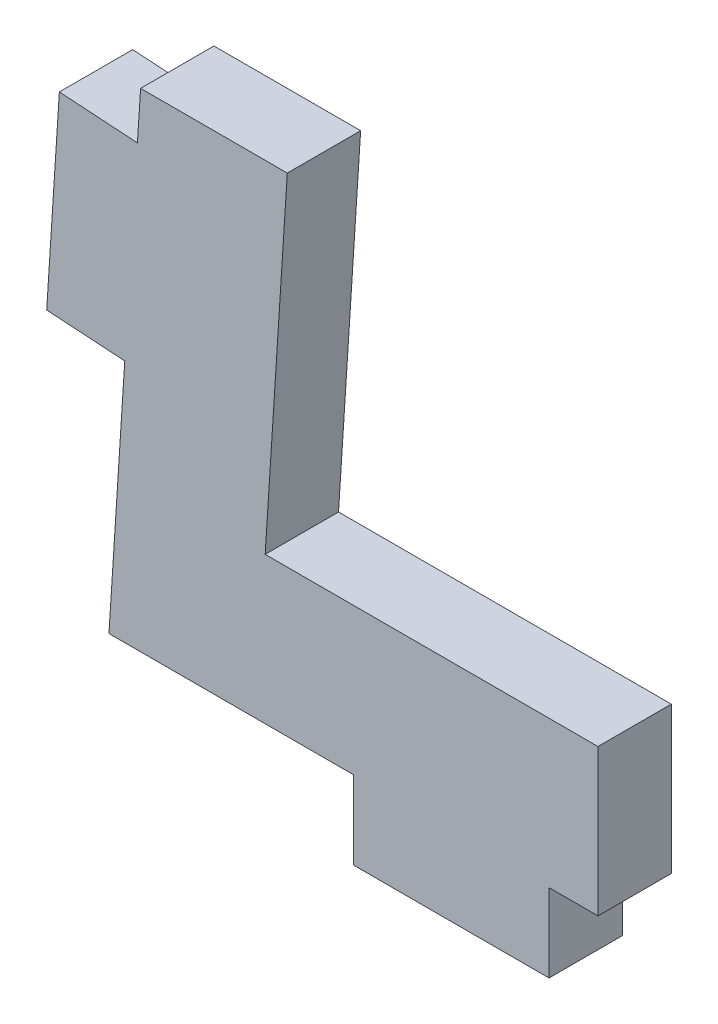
ISO-10303-21;
HEADER;
FILE_DESCRIPTION(('STEP AP214'),'2;1');
FILE_NAME('part.step','',(''),(''),'','','');
FILE_SCHEMA(('AUTOMOTIVE_DESIGN { 1 0 10303 214 1 1 1 1 }'));
ENDSEC;
DATA;
#1=APPLICATION_CONTEXT('core data for automotive mechanical design processes');
#2=APPLICATION_PROTOCOL_DEFINITION('international standard','automotive_design',2000,#1);
#3=PRODUCT_CONTEXT('',#1,'mechanical');
#4=PRODUCT('Part','Part','',(#3));
#5=PRODUCT_RELATED_PRODUCT_CATEGORY('part','',(#4));
#6=PRODUCT_DEFINITION_FORMATION('','',#4);
#7=PRODUCT_DEFINITION_CONTEXT('part definition',#1,'design');
#8=PRODUCT_DEFINITION('design','',#6,#7);
#9=PRODUCT_DEFINITION_SHAPE('','',#8);
#10=(LENGTH_UNIT() NAMED_UNIT(*) SI_UNIT(.MILLI.,.METRE.));
#11=(NAMED_UNIT(*) PLANE_ANGLE_UNIT() SI_UNIT($,.RADIAN.));
#12=(NAMED_UNIT(*) SI_UNIT($,.STERADIAN.) SOLID_ANGLE_UNIT());
#13=UNCERTAINTY_MEASURE_WITH_UNIT(LENGTH_MEASURE(1.E-05),#10,'distance_accuracy_value','');
#14=(GEOMETRIC_REPRESENTATION_CONTEXT(3) GLOBAL_UNCERTAINTY_ASSIGNED_CONTEXT((#13)) GLOBAL_UNIT_ASSIGNED_CONTEXT((#10,
#11,#12)) REPRESENTATION_CONTEXT('',''));
#15=CARTESIAN_POINT('',(0.,0.,0.));
#16=DIRECTION('',(0.,0.,1.));
#17=DIRECTION('',(1.,0.,0.));
#18=AXIS2_PLACEMENT_3D('',#15,#16,#17);
#19=CARTESIAN_POINT('',(0.,0.,3.));
#20=DIRECTION('',(0.,1.,0.));
#21=DIRECTION('',(0.,0.,1.));
#22=AXIS2_PLACEMENT_3D('',#19,#20,#21);
#23=PLANE('',#22);
#24=DIRECTION('',(0.,0.,-1.));
#25=VECTOR('',#24,1.);
#26=CARTESIAN_POINT('',(10.,0.,3.));
#27=LINE('',#26,#25);
#28=CARTESIAN_POINT('',(10.,0.,3.));
#29=VERTEX_POINT('',#28);
#30=CARTESIAN_POINT('',(10.,0.,0.));
#31=VERTEX_POINT('',#30);
#32=EDGE_CURVE('E141',#29,#31,#27,.T.);
#33=ORIENTED_EDGE('',*,*,#32,.F.);
#34=DIRECTION('',(1.,0.,0.));
#35=VECTOR('',#34,1.);
#36=CARTESIAN_POINT('',(0.,0.,3.));
#37=LINE('',#36,#35);
#38=CARTESIAN_POINT('',(0.,0.,3.));
#39=VERTEX_POINT('',#38);
#40=EDGE_CURVE('E158',#39,#29,#37,.T.);
#41=ORIENTED_EDGE('',*,*,#40,.F.);
#42=DIRECTION('',(0.,0.,-1.));
#43=VECTOR('',#42,1.);
#44=CARTESIAN_POINT('',(0.,0.,3.));
#45=LINE('',#44,#43);
#46=CARTESIAN_POINT('',(0.,0.,0.));
#47=VERTEX_POINT('',#46);
#48=EDGE_CURVE('E190',#39,#47,#45,.T.);
#49=ORIENTED_EDGE('',*,*,#48,.T.);
#50=DIRECTION('',(1.,0.,0.));
#51=VECTOR('',#50,1.);
#52=CARTESIAN_POINT('',(0.,0.,0.));
#53=LINE('',#52,#51);
#54=EDGE_CURVE('E185',#47,#31,#53,.T.);
#55=ORIENTED_EDGE('',*,*,#54,.T.);
#56=EDGE_LOOP('',(#33,#41,#49,#55));
#57=FACE_BOUND('',#56,.T.);
#58=ADVANCED_FACE('F35',(#57),#23,.F.);
#59=CARTESIAN_POINT('',(0.,0.,3.));
#60=DIRECTION('',(-0.997904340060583,0.0647064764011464,0.));
#61=DIRECTION('',(-0.0647064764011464,-0.997904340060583,0.));
#62=AXIS2_PLACEMENT_3D('',#59,#60,#61);
#63=PLANE('',#62);
#64=DIRECTION('',(0.0647064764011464,0.997904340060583,0.));
#65=VECTOR('',#64,1.);
#66=CARTESIAN_POINT('',(0.,0.,3.));
#67=LINE('',#66,#65);
#68=CARTESIAN_POINT('',(0.647064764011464,9.97904340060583,3.));
#69=VERTEX_POINT('',#68);
#70=EDGE_CURVE('E159',#39,#69,#67,.T.);
#71=ORIENTED_EDGE('',*,*,#70,.T.);
#72=DIRECTION('',(0.,0.,-1.));
#73=VECTOR('',#72,1.);
#74=CARTESIAN_POINT('',(0.647064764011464,9.97904340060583,3.));
#75=LINE('',#74,#73);
#76=CARTESIAN_POINT('',(0.647064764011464,9.97904340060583,0.));
#77=VERTEX_POINT('',#76);
#78=EDGE_CURVE('E229',#69,#77,#75,.T.);
#79=ORIENTED_EDGE('',*,*,#78,.T.);
#80=DIRECTION('',(0.0647064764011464,0.997904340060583,0.));
#81=VECTOR('',#80,1.);
#82=CARTESIAN_POINT('',(0.,0.,0.));
#83=LINE('',#82,#81);
#84=EDGE_CURVE('E181',#47,#77,#83,.T.);
#85=ORIENTED_EDGE('',*,*,#84,.F.);
#86=ORIENTED_EDGE('',*,*,#48,.F.);
#87=EDGE_LOOP('',(#71,#79,#85,#86));
#88=FACE_BOUND('',#87,.T.);
#89=ADVANCED_FACE('F271',(#88),#63,.T.);
#90=CARTESIAN_POINT('',(20.,0.,3.));
#91=DIRECTION('',(1.,0.,0.));
#92=DIRECTION('',(0.,0.,-1.));
#93=AXIS2_PLACEMENT_3D('',#90,#91,#92);
#94=PLANE('',#93);
#95=DIRECTION('',(0.,-1.,0.));
#96=VECTOR('',#95,1.);
#97=CARTESIAN_POINT('',(20.,0.,0.));
#98=LINE('',#97,#96);
#99=CARTESIAN_POINT('',(20.,6.,0.));
#100=VERTEX_POINT('',#99);
#101=CARTESIAN_POINT('',(20.,0.,0.));
#102=VERTEX_POINT('',#101);
#103=EDGE_CURVE('E167',#100,#102,#98,.T.);
#104=ORIENTED_EDGE('',*,*,#103,.F.);
#105=DIRECTION('',(0.,0.,-1.));
#106=VECTOR('',#105,1.);
#107=CARTESIAN_POINT('',(20.,6.,3.));
#108=LINE('',#107,#106);
#109=CARTESIAN_POINT('',(20.,6.,3.));
#110=VERTEX_POINT('',#109);
#111=EDGE_CURVE('E11',#110,#100,#108,.T.);
#112=ORIENTED_EDGE('',*,*,#111,.F.);
#113=DIRECTION('',(0.,-1.,0.));
#114=VECTOR('',#113,1.);
#115=CARTESIAN_POINT('',(20.,0.,3.));
#116=LINE('',#115,#114);
#117=CARTESIAN_POINT('',(20.,0.,3.));
#118=VERTEX_POINT('',#117);
#119=EDGE_CURVE('E188',#110,#118,#116,.T.);
#120=ORIENTED_EDGE('',*,*,#119,.T.);
#121=DIRECTION('',(0.,0.,-1.));
#122=VECTOR('',#121,1.);
#123=CARTESIAN_POINT('',(20.,0.,3.));
#124=LINE('',#123,#122);
#125=EDGE_CURVE('E156',#118,#102,#124,.T.);
#126=ORIENTED_EDGE('',*,*,#125,.T.);
#127=EDGE_LOOP('',(#104,#112,#120,#126));
#128=FACE_BOUND('',#127,.T.);
#129=ADVANCED_FACE('F37',(#128),#94,.T.);
#130=CARTESIAN_POINT('',(0.,6.,3.));
#131=DIRECTION('',(0.,1.,0.));
#132=DIRECTION('',(0.,0.,1.));
#133=AXIS2_PLACEMENT_3D('',#130,#131,#132);
#134=PLANE('',#133);
#135=DIRECTION('',(1.,0.,0.));
#136=VECTOR('',#135,1.);
#137=CARTESIAN_POINT('',(0.,6.,0.));
#138=LINE('',#137,#136);
#139=CARTESIAN_POINT('',(6.38905418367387,6.,0.));
#140=VERTEX_POINT('',#139);
#141=EDGE_CURVE('E170',#140,#100,#138,.T.);
#142=ORIENTED_EDGE('',*,*,#141,.F.);
#143=DIRECTION('',(0.,0.,-1.));
#144=VECTOR('',#143,1.);
#145=CARTESIAN_POINT('',(6.38905418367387,6.,3.));
#146=LINE('',#145,#144);
#147=CARTESIAN_POINT('',(6.38905418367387,6.,3.));
#148=VERTEX_POINT('',#147);
#149=EDGE_CURVE('E43',#148,#140,#146,.T.);
#150=ORIENTED_EDGE('',*,*,#149,.F.);
#151=DIRECTION('',(1.,0.,0.));
#152=VECTOR('',#151,1.);
#153=CARTESIAN_POINT('',(0.,6.,3.));
#154=LINE('',#153,#152);
#155=EDGE_CURVE('E220',#148,#110,#154,.T.);
#156=ORIENTED_EDGE('',*,*,#155,.T.);
#157=ORIENTED_EDGE('',*,*,#111,.T.);
#158=EDGE_LOOP('',(#142,#150,#156,#157));
#159=FACE_BOUND('',#158,.T.);
#160=ADVANCED_FACE('F206',(#159),#134,.T.);
#161=CARTESIAN_POINT('',(5.97487843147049,-0.387425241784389,3.));
#162=DIRECTION('',(0.997904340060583,-0.0647064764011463,0.));
#163=DIRECTION('',(0.0647064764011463,0.997904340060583,0.));
#164=AXIS2_PLACEMENT_3D('',#161,#162,#163);
#165=PLANE('',#164);
#166=DIRECTION('',(-0.0647064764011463,-0.997904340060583,0.));
#167=VECTOR('',#166,1.);
#168=CARTESIAN_POINT('',(5.97487843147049,-0.387425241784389,0.));
#169=LINE('',#168,#167);
#170=CARTESIAN_POINT('',(7.29412952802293,19.9580868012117,0.));
#171=VERTEX_POINT('',#170);
#172=EDGE_CURVE('E174',#171,#140,#169,.T.);
#173=ORIENTED_EDGE('',*,*,#172,.F.);
#174=DIRECTION('',(0.,0.,-1.));
#175=VECTOR('',#174,1.);
#176=CARTESIAN_POINT('',(7.29412952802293,19.9580868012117,3.));
#177=LINE('',#176,#175);
#178=CARTESIAN_POINT('',(7.29412952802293,19.9580868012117,3.));
#179=VERTEX_POINT('',#178);
#180=EDGE_CURVE('E195',#179,#171,#177,.T.);
#181=ORIENTED_EDGE('',*,*,#180,.F.);
#182=DIRECTION('',(-0.0647064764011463,-0.997904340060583,0.));
#183=VECTOR('',#182,1.);
#184=CARTESIAN_POINT('',(5.97487843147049,-0.387425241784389,3.));
#185=LINE('',#184,#183);
#186=EDGE_CURVE('E202',#179,#148,#185,.T.);
#187=ORIENTED_EDGE('',*,*,#186,.T.);
#188=ORIENTED_EDGE('',*,*,#149,.T.);
#189=EDGE_LOOP('',(#173,#181,#187,#188));
#190=FACE_BOUND('',#189,.T.);
#191=ADVANCED_FACE('F200',(#190),#165,.T.);
#192=CARTESIAN_POINT('',(0.,19.9580868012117,3.));
#193=DIRECTION('',(0.,1.,0.));
#194=DIRECTION('',(0.,0.,1.));
#195=AXIS2_PLACEMENT_3D('',#192,#193,#194);
#196=PLANE('',#195);
#197=DIRECTION('',(1.,0.,0.));
#198=VECTOR('',#197,1.);
#199=CARTESIAN_POINT('',(0.,19.9580868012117,0.));
#200=LINE('',#199,#198);
#201=CARTESIAN_POINT('',(1.29412952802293,19.9580868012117,0.));
#202=VERTEX_POINT('',#201);
#203=EDGE_CURVE('E177',#202,#171,#200,.T.);
#204=ORIENTED_EDGE('',*,*,#203,.F.);
#205=DIRECTION('',(0.,0.,-1.));
#206=VECTOR('',#205,1.);
#207=CARTESIAN_POINT('',(1.29412952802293,19.9580868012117,3.));
#208=LINE('',#207,#206);
#209=CARTESIAN_POINT('',(1.29412952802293,19.9580868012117,3.));
#210=VERTEX_POINT('',#209);
#211=EDGE_CURVE('E192',#210,#202,#208,.T.);
#212=ORIENTED_EDGE('',*,*,#211,.F.);
#213=DIRECTION('',(1.,0.,0.));
#214=VECTOR('',#213,1.);
#215=CARTESIAN_POINT('',(0.,19.9580868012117,3.));
#216=LINE('',#215,#214);
#217=EDGE_CURVE('E218',#210,#179,#216,.T.);
#218=ORIENTED_EDGE('',*,*,#217,.T.);
#219=ORIENTED_EDGE('',*,*,#180,.T.);
#220=EDGE_LOOP('',(#204,#212,#218,#219));
#221=FACE_BOUND('',#220,.T.);
#222=ADVANCED_FACE('F215',(#221),#196,.T.);
#223=DIRECTION('',(0.,0.,-1.));
#224=VECTOR('',#223,1.);
#225=CARTESIAN_POINT('',(1.16471657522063,17.9622781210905,3.));
#226=LINE('',#225,#224);
#227=CARTESIAN_POINT('',(1.16471657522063,17.9622781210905,3.));
#228=VERTEX_POINT('',#227);
#229=CARTESIAN_POINT('',(1.16471657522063,17.9622781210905,0.));
#230=VERTEX_POINT('',#229);
#231=EDGE_CURVE('E231',#228,#230,#226,.T.);
#232=ORIENTED_EDGE('',*,*,#231,.F.);
#233=EDGE_CURVE('E163',#228,#210,#67,.T.);
#234=ORIENTED_EDGE('',*,*,#233,.T.);
#235=ORIENTED_EDGE('',*,*,#211,.T.);
#236=EDGE_CURVE('E180',#230,#202,#83,.T.);
#237=ORIENTED_EDGE('',*,*,#236,.F.);
#238=EDGE_LOOP('',(#232,#234,#235,#237));
#239=FACE_BOUND('',#238,.T.);
#240=ADVANCED_FACE('F278',(#239),#63,.T.);
#241=CARTESIAN_POINT('',(18.,0.,3.));
#242=VERTEX_POINT('',#241);
#243=EDGE_CURVE('E146',#242,#118,#37,.T.);
#244=ORIENTED_EDGE('',*,*,#243,.F.);
#245=DIRECTION('',(0.,0.,-1.));
#246=VECTOR('',#245,1.);
#247=CARTESIAN_POINT('',(18.,0.,3.));
#248=LINE('',#247,#246);
#249=CARTESIAN_POINT('',(18.,0.,0.));
#250=VERTEX_POINT('',#249);
#251=EDGE_CURVE('E133',#242,#250,#248,.T.);
#252=ORIENTED_EDGE('',*,*,#251,.T.);
#253=EDGE_CURVE('E184',#250,#102,#53,.T.);
#254=ORIENTED_EDGE('',*,*,#253,.T.);
#255=ORIENTED_EDGE('',*,*,#125,.F.);
#256=EDGE_LOOP('',(#244,#252,#254,#255));
#257=FACE_BOUND('',#256,.T.);
#258=ADVANCED_FACE('F154',(#257),#23,.F.);
#259=CARTESIAN_POINT('',(0.,0.,3.));
#260=DIRECTION('',(0.,0.,1.));
#261=DIRECTION('',(1.,0.,0.));
#262=AXIS2_PLACEMENT_3D('',#259,#260,#261);
#263=PLANE('',#262);
#264=ORIENTED_EDGE('',*,*,#119,.F.);
#265=ORIENTED_EDGE('',*,*,#155,.F.);
#266=ORIENTED_EDGE('',*,*,#186,.F.);
#267=ORIENTED_EDGE('',*,*,#217,.F.);
#268=ORIENTED_EDGE('',*,*,#233,.F.);
#269=DIRECTION('',(-0.997904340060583,0.0647064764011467,0.));
#270=VECTOR('',#269,1.);
#271=CARTESIAN_POINT('',(1.16471657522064,17.9622781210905,3.));
#272=LINE('',#271,#270);
#273=CARTESIAN_POINT('',(-2.02857731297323,18.1693388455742,3.));
#274=VERTEX_POINT('',#273);
#275=EDGE_CURVE('E235',#228,#274,#272,.T.);
#276=ORIENTED_EDGE('',*,*,#275,.T.);
#277=DIRECTION('',(-0.0647064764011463,-0.997904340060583,0.));
#278=VECTOR('',#277,1.);
#279=CARTESIAN_POINT('',(-3.19329388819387,0.207060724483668,3.));
#280=LINE('',#279,#278);
#281=CARTESIAN_POINT('',(-2.5462291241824,10.1861041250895,3.));
#282=VERTEX_POINT('',#281);
#283=EDGE_CURVE('E243',#274,#282,#280,.T.);
#284=ORIENTED_EDGE('',*,*,#283,.T.);
#285=DIRECTION('',(-0.997904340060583,0.0647064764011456,0.));
#286=VECTOR('',#285,1.);
#287=CARTESIAN_POINT('',(0.647064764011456,9.97904340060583,3.));
#288=LINE('',#287,#286);
#289=EDGE_CURVE('E233',#69,#282,#288,.T.);
#290=ORIENTED_EDGE('',*,*,#289,.F.);
#291=ORIENTED_EDGE('',*,*,#70,.F.);
#292=ORIENTED_EDGE('',*,*,#40,.T.);
#293=DIRECTION('',(0.,-1.,0.));
#294=VECTOR('',#293,1.);
#295=CARTESIAN_POINT('',(10.,0.,3.));
#296=LINE('',#295,#294);
#297=CARTESIAN_POINT('',(10.,-3.2,3.));
#298=VERTEX_POINT('',#297);
#299=EDGE_CURVE('E151',#29,#298,#296,.T.);
#300=ORIENTED_EDGE('',*,*,#299,.T.);
#301=DIRECTION('',(1.,0.,0.));
#302=VECTOR('',#301,1.);
#303=CARTESIAN_POINT('',(0.,-3.2,3.));
#304=LINE('',#303,#302);
#305=CARTESIAN_POINT('',(18.,-3.2,3.));
#306=VERTEX_POINT('',#305);
#307=EDGE_CURVE('E149',#298,#306,#304,.T.);
#308=ORIENTED_EDGE('',*,*,#307,.T.);
#309=DIRECTION('',(0.,-1.,0.));
#310=VECTOR('',#309,1.);
#311=CARTESIAN_POINT('',(18.,0.,3.));
#312=LINE('',#311,#310);
#313=EDGE_CURVE('E136',#242,#306,#312,.T.);
#314=ORIENTED_EDGE('',*,*,#313,.F.);
#315=ORIENTED_EDGE('',*,*,#243,.T.);
#316=EDGE_LOOP('',(#264,#265,#266,#267,#268,#276,#284,#290,#291,#292,#300,#308,#314,#315));
#317=FACE_BOUND('',#316,.T.);
#318=ADVANCED_FACE('F145',(#317),#263,.T.);
#319=CARTESIAN_POINT('',(0.,0.,0.));
#320=DIRECTION('',(0.,0.,1.));
#321=DIRECTION('',(1.,0.,0.));
#322=AXIS2_PLACEMENT_3D('',#319,#320,#321);
#323=PLANE('',#322);
#324=ORIENTED_EDGE('',*,*,#103,.T.);
#325=ORIENTED_EDGE('',*,*,#253,.F.);
#326=DIRECTION('',(0.,-1.,0.));
#327=VECTOR('',#326,1.);
#328=CARTESIAN_POINT('',(18.,0.,0.));
#329=LINE('',#328,#327);
#330=CARTESIAN_POINT('',(18.,-3.2,0.));
#331=VERTEX_POINT('',#330);
#332=EDGE_CURVE('E50',#250,#331,#329,.T.);
#333=ORIENTED_EDGE('',*,*,#332,.T.);
#334=DIRECTION('',(1.,0.,0.));
#335=VECTOR('',#334,1.);
#336=CARTESIAN_POINT('',(0.,-3.2,0.));
#337=LINE('',#336,#335);
#338=CARTESIAN_POINT('',(10.,-3.2,0.));
#339=VERTEX_POINT('',#338);
#340=EDGE_CURVE('E152',#339,#331,#337,.T.);
#341=ORIENTED_EDGE('',*,*,#340,.F.);
#342=DIRECTION('',(0.,-1.,0.));
#343=VECTOR('',#342,1.);
#344=CARTESIAN_POINT('',(10.,0.,0.));
#345=LINE('',#344,#343);
#346=EDGE_CURVE('E255',#31,#339,#345,.T.);
#347=ORIENTED_EDGE('',*,*,#346,.F.);
#348=ORIENTED_EDGE('',*,*,#54,.F.);
#349=ORIENTED_EDGE('',*,*,#84,.T.);
#350=DIRECTION('',(-0.997904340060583,0.0647064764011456,0.));
#351=VECTOR('',#350,1.);
#352=CARTESIAN_POINT('',(0.647064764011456,9.97904340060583,0.));
#353=LINE('',#352,#351);
#354=CARTESIAN_POINT('',(-2.5462291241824,10.1861041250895,0.));
#355=VERTEX_POINT('',#354);
#356=EDGE_CURVE('E58',#77,#355,#353,.T.);
#357=ORIENTED_EDGE('',*,*,#356,.T.);
#358=DIRECTION('',(-0.0647064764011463,-0.997904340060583,0.));
#359=VECTOR('',#358,1.);
#360=CARTESIAN_POINT('',(-3.19329388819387,0.207060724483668,0.));
#361=LINE('',#360,#359);
#362=CARTESIAN_POINT('',(-2.02857731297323,18.1693388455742,0.));
#363=VERTEX_POINT('',#362);
#364=EDGE_CURVE('E236',#363,#355,#361,.T.);
#365=ORIENTED_EDGE('',*,*,#364,.F.);
#366=DIRECTION('',(-0.997904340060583,0.0647064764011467,0.));
#367=VECTOR('',#366,1.);
#368=CARTESIAN_POINT('',(1.16471657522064,17.9622781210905,0.));
#369=LINE('',#368,#367);
#370=EDGE_CURVE('E140',#230,#363,#369,.T.);
#371=ORIENTED_EDGE('',*,*,#370,.F.);
#372=ORIENTED_EDGE('',*,*,#236,.T.);
#373=ORIENTED_EDGE('',*,*,#203,.T.);
#374=ORIENTED_EDGE('',*,*,#172,.T.);
#375=ORIENTED_EDGE('',*,*,#141,.T.);
#376=EDGE_LOOP('',(#324,#325,#333,#341,#347,#348,#349,#357,#365,#371,#372,#373,#374,#375));
#377=FACE_BOUND('',#376,.T.);
#378=ADVANCED_FACE('F209',(#377),#323,.F.);
#379=CARTESIAN_POINT('',(1.16471657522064,17.9622781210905,3.));
#380=DIRECTION('',(-0.0647064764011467,-0.997904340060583,0.));
#381=DIRECTION('',(0.997904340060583,-0.0647064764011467,0.));
#382=AXIS2_PLACEMENT_3D('',#379,#380,#381);
#383=PLANE('',#382);
#384=ORIENTED_EDGE('',*,*,#370,.T.);
#385=DIRECTION('',(0.,0.,-1.));
#386=VECTOR('',#385,1.);
#387=CARTESIAN_POINT('',(-2.02857731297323,18.1693388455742,3.));
#388=LINE('',#387,#386);
#389=EDGE_CURVE('E171',#274,#363,#388,.T.);
#390=ORIENTED_EDGE('',*,*,#389,.F.);
#391=ORIENTED_EDGE('',*,*,#275,.F.);
#392=ORIENTED_EDGE('',*,*,#231,.T.);
#393=EDGE_LOOP('',(#384,#390,#391,#392));
#394=FACE_BOUND('',#393,.T.);
#395=ADVANCED_FACE('F347',(#394),#383,.F.);
#396=CARTESIAN_POINT('',(-3.19329388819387,0.207060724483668,3.));
#397=DIRECTION('',(0.997904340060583,-0.0647064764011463,0.));
#398=DIRECTION('',(0.0647064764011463,0.997904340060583,0.));
#399=AXIS2_PLACEMENT_3D('',#396,#397,#398);
#400=PLANE('',#399);
#401=ORIENTED_EDGE('',*,*,#364,.T.);
#402=DIRECTION('',(0.,0.,-1.));
#403=VECTOR('',#402,1.);
#404=CARTESIAN_POINT('',(-2.5462291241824,10.1861041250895,3.));
#405=LINE('',#404,#403);
#406=EDGE_CURVE('E227',#282,#355,#405,.T.);
#407=ORIENTED_EDGE('',*,*,#406,.F.);
#408=ORIENTED_EDGE('',*,*,#283,.F.);
#409=ORIENTED_EDGE('',*,*,#389,.T.);
#410=EDGE_LOOP('',(#401,#407,#408,#409));
#411=FACE_BOUND('',#410,.T.);
#412=ADVANCED_FACE('F355',(#411),#400,.F.);
#413=CARTESIAN_POINT('',(0.647064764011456,9.97904340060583,3.));
#414=DIRECTION('',(-0.0647064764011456,-0.997904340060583,0.));
#415=DIRECTION('',(0.997904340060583,-0.0647064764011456,0.));
#416=AXIS2_PLACEMENT_3D('',#413,#414,#415);
#417=PLANE('',#416);
#418=ORIENTED_EDGE('',*,*,#356,.F.);
#419=ORIENTED_EDGE('',*,*,#78,.F.);
#420=ORIENTED_EDGE('',*,*,#289,.T.);
#421=ORIENTED_EDGE('',*,*,#406,.T.);
#422=EDGE_LOOP('',(#418,#419,#420,#421));
#423=FACE_BOUND('',#422,.T.);
#424=ADVANCED_FACE('F365',(#423),#417,.T.);
#425=CARTESIAN_POINT('',(18.,0.,3.));
#426=DIRECTION('',(1.,0.,0.));
#427=DIRECTION('',(0.,0.,-1.));
#428=AXIS2_PLACEMENT_3D('',#425,#426,#427);
#429=PLANE('',#428);
#430=ORIENTED_EDGE('',*,*,#332,.F.);
#431=ORIENTED_EDGE('',*,*,#251,.F.);
#432=ORIENTED_EDGE('',*,*,#313,.T.);
#433=DIRECTION('',(0.,0.,-1.));
#434=VECTOR('',#433,1.);
#435=CARTESIAN_POINT('',(18.,-3.2,3.));
#436=LINE('',#435,#434);
#437=EDGE_CURVE('E251',#306,#331,#436,.T.);
#438=ORIENTED_EDGE('',*,*,#437,.T.);
#439=EDGE_LOOP('',(#430,#431,#432,#438));
#440=FACE_BOUND('',#439,.T.);
#441=ADVANCED_FACE('F135',(#440),#429,.T.);
#442=CARTESIAN_POINT('',(10.,0.,3.));
#443=DIRECTION('',(1.,0.,0.));
#444=DIRECTION('',(0.,0.,-1.));
#445=AXIS2_PLACEMENT_3D('',#442,#443,#444);
#446=PLANE('',#445);
#447=ORIENTED_EDGE('',*,*,#346,.T.);
#448=DIRECTION('',(0.,0.,-1.));
#449=VECTOR('',#448,1.);
#450=CARTESIAN_POINT('',(10.,-3.2,3.));
#451=LINE('',#450,#449);
#452=EDGE_CURVE('E248',#298,#339,#451,.T.);
#453=ORIENTED_EDGE('',*,*,#452,.F.);
#454=ORIENTED_EDGE('',*,*,#299,.F.);
#455=ORIENTED_EDGE('',*,*,#32,.T.);
#456=EDGE_LOOP('',(#447,#453,#454,#455));
#457=FACE_BOUND('',#456,.T.);
#458=ADVANCED_FACE('F264',(#457),#446,.F.);
#459=CARTESIAN_POINT('',(0.,-3.2,3.));
#460=DIRECTION('',(0.,1.,0.));
#461=DIRECTION('',(0.,0.,1.));
#462=AXIS2_PLACEMENT_3D('',#459,#460,#461);
#463=PLANE('',#462);
#464=ORIENTED_EDGE('',*,*,#340,.T.);
#465=ORIENTED_EDGE('',*,*,#437,.F.);
#466=ORIENTED_EDGE('',*,*,#307,.F.);
#467=ORIENTED_EDGE('',*,*,#452,.T.);
#468=EDGE_LOOP('',(#464,#465,#466,#467));
#469=FACE_BOUND('',#468,.T.);
#470=ADVANCED_FACE('F268',(#469),#463,.F.);
#471=CLOSED_SHELL('',(#58,#89,#129,#160,#191,#222,#240,#258,#318,#378,#395,#412,#424,#441,#458,#470));
#472=MANIFOLD_SOLID_BREP('B2',#471);
#473=ADVANCED_BREP_SHAPE_REPRESENTATION('',(#18,#472),#14);
#474=SHAPE_DEFINITION_REPRESENTATION(#9,#473);
ENDSEC;
END-ISO-10303-21;
